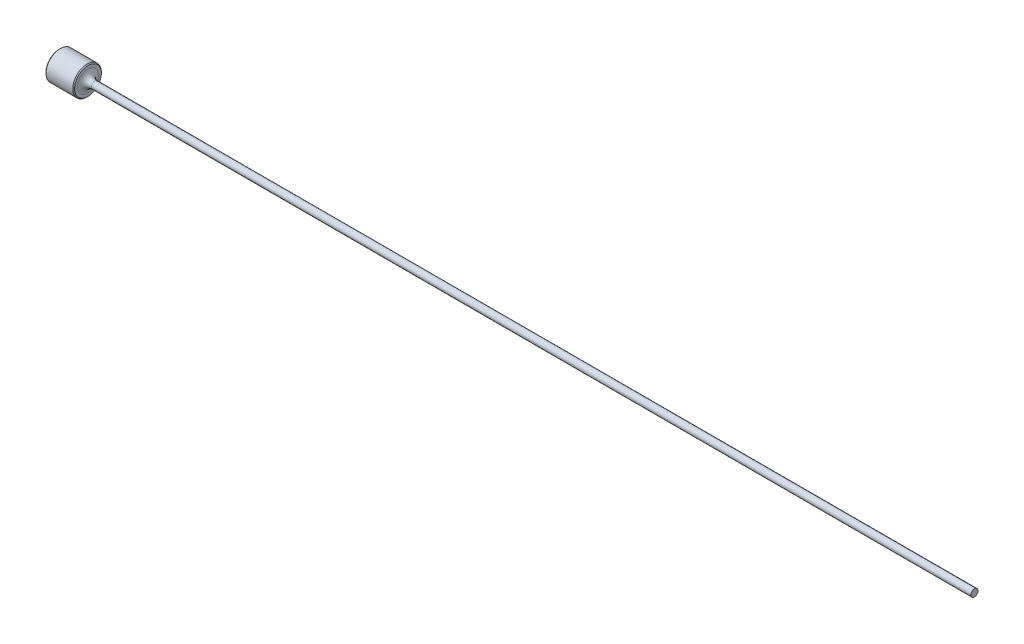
ISO-10303-21;
HEADER;
FILE_DESCRIPTION(('STEP AP214'),'2;1');
FILE_NAME('part.step','',(''),(''),'','','');
FILE_SCHEMA(('AUTOMOTIVE_DESIGN { 1 0 10303 214 1 1 1 1 }'));
ENDSEC;
DATA;
#1=APPLICATION_CONTEXT('core data for automotive mechanical design processes');
#2=APPLICATION_PROTOCOL_DEFINITION('international standard','automotive_design',2000,#1);
#3=PRODUCT_CONTEXT('',#1,'mechanical');
#4=PRODUCT('Part','Part','',(#3));
#5=PRODUCT_RELATED_PRODUCT_CATEGORY('part','',(#4));
#6=PRODUCT_DEFINITION_FORMATION('','',#4);
#7=PRODUCT_DEFINITION_CONTEXT('part definition',#1,'design');
#8=PRODUCT_DEFINITION('design','',#6,#7);
#9=PRODUCT_DEFINITION_SHAPE('','',#8);
#10=(LENGTH_UNIT() NAMED_UNIT(*) SI_UNIT(.MILLI.,.METRE.));
#11=(NAMED_UNIT(*) PLANE_ANGLE_UNIT() SI_UNIT($,.RADIAN.));
#12=(NAMED_UNIT(*) SI_UNIT($,.STERADIAN.) SOLID_ANGLE_UNIT());
#13=UNCERTAINTY_MEASURE_WITH_UNIT(LENGTH_MEASURE(1.E-05),#10,'distance_accuracy_value','');
#14=(GEOMETRIC_REPRESENTATION_CONTEXT(3) GLOBAL_UNCERTAINTY_ASSIGNED_CONTEXT((#13)) GLOBAL_UNIT_ASSIGNED_CONTEXT((#10,
#11,#12)) REPRESENTATION_CONTEXT('',''));
#15=CARTESIAN_POINT('',(0.,0.,0.));
#16=DIRECTION('',(0.,0.,1.));
#17=DIRECTION('',(1.,0.,0.));
#18=AXIS2_PLACEMENT_3D('',#15,#16,#17);
#19=CARTESIAN_POINT('',(101.6,0.393064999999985,0.));
#20=DIRECTION('',(1.,0.,0.));
#21=DIRECTION('',(0.,1.,0.));
#22=AXIS2_PLACEMENT_3D('',#19,#20,#21);
#23=PLANE('',#22);
#24=CARTESIAN_POINT('',(101.6,0.,0.));
#25=DIRECTION('',(1.,0.,0.));
#26=DIRECTION('',(0.,1.,0.));
#27=AXIS2_PLACEMENT_3D('',#24,#25,#26);
#28=CIRCLE('',#27,0.393064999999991);
#29=CARTESIAN_POINT('',(101.6,0.393064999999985,0.));
#30=VERTEX_POINT('',#29);
#31=EDGE_CURVE('E50',#30,#30,#28,.T.);
#32=ORIENTED_EDGE('',*,*,#31,.T.);
#33=EDGE_LOOP('',(#32));
#34=FACE_BOUND('',#33,.T.);
#35=ADVANCED_FACE('F30',(#34),#23,.T.);
#36=CARTESIAN_POINT('',(101.6,0.,0.));
#37=DIRECTION('',(1.,0.,0.));
#38=DIRECTION('',(0.,1.,0.));
#39=AXIS2_PLACEMENT_3D('',#36,#37,#38);
#40=CYLINDRICAL_SURFACE('',#39,0.393064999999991);
#41=CARTESIAN_POINT('',(3.937,0.,0.));
#42=DIRECTION('',(1.,0.,0.));
#43=DIRECTION('',(0.,1.,0.));
#44=AXIS2_PLACEMENT_3D('',#41,#42,#43);
#45=CIRCLE('',#44,0.393064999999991);
#46=CARTESIAN_POINT('',(3.937,0.393064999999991,0.));
#47=VERTEX_POINT('',#46);
#48=EDGE_CURVE('E53',#47,#47,#45,.T.);
#49=ORIENTED_EDGE('',*,*,#48,.T.);
#50=EDGE_LOOP('',(#49));
#51=FACE_BOUND('',#50,.T.);
#52=ORIENTED_EDGE('',*,*,#31,.F.);
#53=EDGE_LOOP('',(#52));
#54=FACE_BOUND('',#53,.T.);
#55=ADVANCED_FACE('F74',(#51,#54),#40,.T.);
#56=CARTESIAN_POINT('',(3.937,0.,0.));
#57=DIRECTION('',(1.,0.,0.));
#58=DIRECTION('',(0.,1.,0.));
#59=AXIS2_PLACEMENT_3D('',#56,#57,#58);
#60=TOROIDAL_SURFACE('',#59,1.15506499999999,0.762);
#61=CARTESIAN_POINT('',(3.175,0.,0.));
#62=DIRECTION('',(1.,0.,0.));
#63=DIRECTION('',(0.,1.,0.));
#64=AXIS2_PLACEMENT_3D('',#61,#62,#63);
#65=CIRCLE('',#64,1.15506499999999);
#66=CARTESIAN_POINT('',(3.175,1.15506499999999,0.));
#67=VERTEX_POINT('',#66);
#68=EDGE_CURVE('E56',#67,#67,#65,.T.);
#69=ORIENTED_EDGE('',*,*,#68,.T.);
#70=EDGE_LOOP('',(#69));
#71=FACE_BOUND('',#70,.T.);
#72=ORIENTED_EDGE('',*,*,#48,.F.);
#73=EDGE_LOOP('',(#72));
#74=FACE_BOUND('',#73,.T.);
#75=ADVANCED_FACE('F60',(#71,#74),#60,.F.);
#76=CARTESIAN_POINT('',(3.175,1.5875,0.));
#77=DIRECTION('',(1.,0.,0.));
#78=DIRECTION('',(0.,1.,0.));
#79=AXIS2_PLACEMENT_3D('',#76,#77,#78);
#80=PLANE('',#79);
#81=CARTESIAN_POINT('',(3.175,0.,0.));
#82=DIRECTION('',(1.,0.,0.));
#83=DIRECTION('',(0.,1.,0.));
#84=AXIS2_PLACEMENT_3D('',#81,#82,#83);
#85=CIRCLE('',#84,1.48590000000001);
#86=CARTESIAN_POINT('',(3.175,1.48590000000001,0.));
#87=VERTEX_POINT('',#86);
#88=EDGE_CURVE('E10',#87,#87,#85,.T.);
#89=ORIENTED_EDGE('',*,*,#88,.T.);
#90=EDGE_LOOP('',(#89));
#91=FACE_BOUND('',#90,.T.);
#92=ORIENTED_EDGE('',*,*,#68,.F.);
#93=EDGE_LOOP('',(#92));
#94=FACE_BOUND('',#93,.T.);
#95=ADVANCED_FACE('F63',(#91,#94),#80,.T.);
#96=CARTESIAN_POINT('',(101.6,0.,0.));
#97=DIRECTION('',(1.,0.,0.));
#98=DIRECTION('',(0.,1.,0.));
#99=AXIS2_PLACEMENT_3D('',#96,#97,#98);
#100=CYLINDRICAL_SURFACE('',#99,1.5875);
#101=CARTESIAN_POINT('',(0.101599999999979,0.,0.));
#102=DIRECTION('',(-1.,0.,0.));
#103=DIRECTION('',(0.,-1.,0.));
#104=AXIS2_PLACEMENT_3D('',#101,#102,#103);
#105=CIRCLE('',#104,1.5875);
#106=CARTESIAN_POINT('',(0.101599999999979,-1.5875,0.));
#107=VERTEX_POINT('',#106);
#108=EDGE_CURVE('E41',#107,#107,#105,.F.);
#109=ORIENTED_EDGE('',*,*,#108,.T.);
#110=EDGE_LOOP('',(#109));
#111=FACE_BOUND('',#110,.T.);
#112=CARTESIAN_POINT('',(3.0734,0.,0.));
#113=DIRECTION('',(1.,0.,0.));
#114=DIRECTION('',(0.,1.,0.));
#115=AXIS2_PLACEMENT_3D('',#112,#113,#114);
#116=CIRCLE('',#115,1.5875);
#117=CARTESIAN_POINT('',(3.0734,1.5875,0.));
#118=VERTEX_POINT('',#117);
#119=EDGE_CURVE('E45',#118,#118,#116,.F.);
#120=ORIENTED_EDGE('',*,*,#119,.T.);
#121=EDGE_LOOP('',(#120));
#122=FACE_BOUND('',#121,.T.);
#123=ADVANCED_FACE('F65',(#111,#122),#100,.T.);
#124=CARTESIAN_POINT('',(0.,0.,0.));
#125=DIRECTION('',(-1.,0.,0.));
#126=DIRECTION('',(0.,-1.,0.));
#127=AXIS2_PLACEMENT_3D('',#124,#125,#126);
#128=PLANE('',#127);
#129=CARTESIAN_POINT('',(0.,0.,0.));
#130=DIRECTION('',(-1.,0.,0.));
#131=DIRECTION('',(0.,-1.,0.));
#132=AXIS2_PLACEMENT_3D('',#129,#130,#131);
#133=CIRCLE('',#132,1.48590000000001);
#134=CARTESIAN_POINT('',(0.,-1.48590000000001,0.));
#135=VERTEX_POINT('',#134);
#136=EDGE_CURVE('E37',#135,#135,#133,.T.);
#137=ORIENTED_EDGE('',*,*,#136,.T.);
#138=EDGE_LOOP('',(#137));
#139=FACE_BOUND('',#138,.T.);
#140=ADVANCED_FACE('F71',(#139),#128,.T.);
#141=CARTESIAN_POINT('',(0.101599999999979,0.,0.));
#142=DIRECTION('',(1.,0.,0.));
#143=DIRECTION('',(0.,1.,0.));
#144=AXIS2_PLACEMENT_3D('',#141,#142,#143);
#145=CONICAL_SURFACE('',#144,1.5875,0.78539816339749);
#146=ORIENTED_EDGE('',*,*,#136,.F.);
#147=EDGE_LOOP('',(#146));
#148=FACE_BOUND('',#147,.T.);
#149=ORIENTED_EDGE('',*,*,#108,.F.);
#150=EDGE_LOOP('',(#149));
#151=FACE_BOUND('',#150,.T.);
#152=ADVANCED_FACE('F84',(#148,#151),#145,.T.);
#153=CARTESIAN_POINT('',(3.175,0.,0.));
#154=DIRECTION('',(-1.,0.,0.));
#155=DIRECTION('',(0.,-1.,0.));
#156=AXIS2_PLACEMENT_3D('',#153,#154,#155);
#157=CONICAL_SURFACE('',#156,1.48590000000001,0.78539816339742);
#158=ORIENTED_EDGE('',*,*,#119,.F.);
#159=EDGE_LOOP('',(#158));
#160=FACE_BOUND('',#159,.T.);
#161=ORIENTED_EDGE('',*,*,#88,.F.);
#162=EDGE_LOOP('',(#161));
#163=FACE_BOUND('',#162,.T.);
#164=ADVANCED_FACE('F32',(#160,#163),#157,.T.);
#165=CLOSED_SHELL('',(#35,#55,#75,#95,#123,#140,#152,#164));
#166=MANIFOLD_SOLID_BREP('B2',#165);
#167=ADVANCED_BREP_SHAPE_REPRESENTATION('',(#18,#166),#14);
#168=SHAPE_DEFINITION_REPRESENTATION(#9,#167);
ENDSEC;
END-ISO-10303-21;
